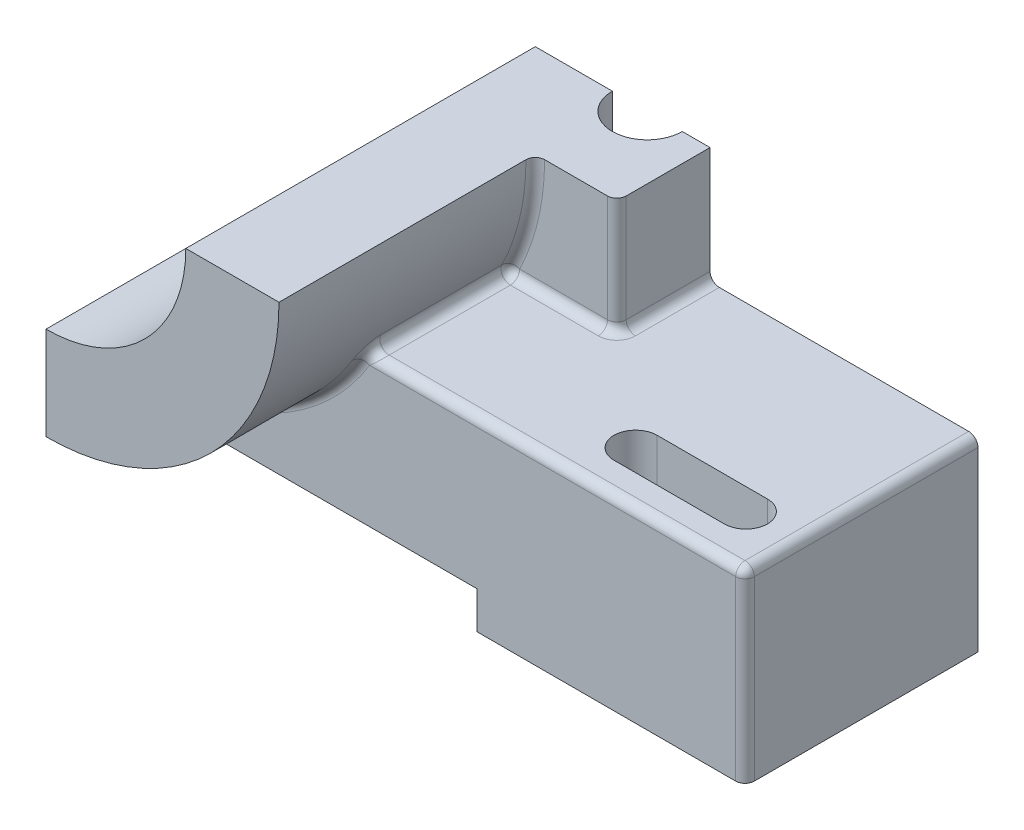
ISO-10303-21;
HEADER;
FILE_DESCRIPTION(('STEP AP214'),'2;1');
FILE_NAME('part.step','',(''),(''),'','','');
FILE_SCHEMA(('AUTOMOTIVE_DESIGN { 1 0 10303 214 1 1 1 1 }'));
ENDSEC;
DATA;
#1=APPLICATION_CONTEXT('core data for automotive mechanical design processes');
#2=APPLICATION_PROTOCOL_DEFINITION('international standard','automotive_design',2000,#1);
#3=PRODUCT_CONTEXT('',#1,'mechanical');
#4=PRODUCT('Part','Part','',(#3));
#5=PRODUCT_RELATED_PRODUCT_CATEGORY('part','',(#4));
#6=PRODUCT_DEFINITION_FORMATION('','',#4);
#7=PRODUCT_DEFINITION_CONTEXT('part definition',#1,'design');
#8=PRODUCT_DEFINITION('design','',#6,#7);
#9=PRODUCT_DEFINITION_SHAPE('','',#8);
#10=(LENGTH_UNIT() NAMED_UNIT(*) SI_UNIT(.MILLI.,.METRE.));
#11=(NAMED_UNIT(*) PLANE_ANGLE_UNIT() SI_UNIT($,.RADIAN.));
#12=(NAMED_UNIT(*) SI_UNIT($,.STERADIAN.) SOLID_ANGLE_UNIT());
#13=UNCERTAINTY_MEASURE_WITH_UNIT(LENGTH_MEASURE(1.E-05),#10,'distance_accuracy_value','');
#14=(GEOMETRIC_REPRESENTATION_CONTEXT(3) GLOBAL_UNCERTAINTY_ASSIGNED_CONTEXT((#13)) GLOBAL_UNIT_ASSIGNED_CONTEXT((#10,
#11,#12)) REPRESENTATION_CONTEXT('',''));
#15=CARTESIAN_POINT('',(0.,0.,0.));
#16=DIRECTION('',(0.,0.,1.));
#17=DIRECTION('',(1.,0.,0.));
#18=AXIS2_PLACEMENT_3D('',#15,#16,#17);
#19=CARTESIAN_POINT('',(0.,0.,75.));
#20=DIRECTION('',(0.,0.,-1.));
#21=DIRECTION('',(-1.,0.,0.));
#22=AXIS2_PLACEMENT_3D('',#19,#20,#21);
#23=CYLINDRICAL_SURFACE('',#22,50.);
#24=DIRECTION('',(0.,0.,-1.));
#25=VECTOR('',#24,1.);
#26=CARTESIAN_POINT('',(0.,-50.,75.));
#27=LINE('',#26,#25);
#28=CARTESIAN_POINT('',(0.,-50.,75.));
#29=VERTEX_POINT('',#28);
#30=CARTESIAN_POINT('',(0.,-50.,52.));
#31=VERTEX_POINT('',#30);
#32=EDGE_CURVE('E270',#29,#31,#27,.T.);
#33=ORIENTED_EDGE('',*,*,#32,.T.);
#34=CARTESIAN_POINT('',(0.,0.,52.));
#35=DIRECTION('',(0.,0.,1.));
#36=DIRECTION('',(1.,0.,0.));
#37=AXIS2_PLACEMENT_3D('',#34,#35,#36);
#38=CIRCLE('',#37,50.);
#39=CARTESIAN_POINT('',(42.7317039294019,-25.9615384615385,52.));
#40=VERTEX_POINT('',#39);
#41=EDGE_CURVE('E349',#31,#40,#38,.T.);
#42=ORIENTED_EDGE('',*,*,#41,.T.);
#43=CARTESIAN_POINT('',(41.6193649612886,-27.7097177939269,51.5629326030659));
#44=CARTESIAN_POINT('',(41.7673239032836,-27.487486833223,50.9343795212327));
#45=CARTESIAN_POINT('',(42.2320413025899,-27.5431307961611,50.4370879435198));
#46=CARTESIAN_POINT('',(42.6967587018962,-27.5987747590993,49.939796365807));
#47=CARTESIAN_POINT('',(43.2841395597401,-27.909053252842,49.7814663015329));
#48=CARTESIAN_POINT('',(41.6885360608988,-27.6058269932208,51.6180455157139));
#49=CARTESIAN_POINT('',(41.8288363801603,-27.3938964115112,50.9740695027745));
#50=CARTESIAN_POINT('',(42.2955432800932,-27.4637496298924,50.4676328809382));
#51=CARTESIAN_POINT('',(42.762431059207,-27.533377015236,49.9612844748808));
#52=CARTESIAN_POINT('',(43.3560775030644,-27.8550300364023,49.8090227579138));
#53=CARTESIAN_POINT('',(41.7584201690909,-27.5000154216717,51.6680242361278));
#54=CARTESIAN_POINT('',(41.8906623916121,-27.2991381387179,51.0089631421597));
#55=CARTESIAN_POINT('',(42.3594915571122,-27.3834538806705,50.4940658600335));
#56=CARTESIAN_POINT('',(42.8285081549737,-27.4675333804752,49.9792343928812));
#57=CARTESIAN_POINT('',(43.4287569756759,-27.8000080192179,49.8340121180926));
#58=CARTESIAN_POINT('',(41.8992133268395,-27.2850222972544,51.7576615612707));
#59=CARTESIAN_POINT('',(42.0146865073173,-27.1076310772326,51.069378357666));
#60=CARTESIAN_POINT('',(42.4878556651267,-27.2215818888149,50.5388060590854));
#61=CARTESIAN_POINT('',(42.9612126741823,-27.335295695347,50.0082987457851));
#62=CARTESIAN_POINT('',(43.575181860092,-27.6882115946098,49.8788307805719));
#63=CARTESIAN_POINT('',(41.970122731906,-27.175839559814,51.797316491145));
#64=CARTESIAN_POINT('',(42.0768917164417,-27.0108666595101,51.0948719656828));
#65=CARTESIAN_POINT('',(42.5522716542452,-27.1400052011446,50.5571103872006));
#66=CARTESIAN_POINT('',(43.0278482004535,-27.2688935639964,50.0193920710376));
#67=CARTESIAN_POINT('',(43.648927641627,-27.6314365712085,49.8986582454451));
#68=CARTESIAN_POINT('',(42.1824934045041,-26.8459486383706,51.9000749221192));
#69=CARTESIAN_POINT('',(42.2625789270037,-26.7198066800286,51.1570708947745));
#70=CARTESIAN_POINT('',(42.7444121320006,-26.8956654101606,50.5997051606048));
#71=CARTESIAN_POINT('',(43.2270106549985,-27.0705512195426,50.0425097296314));
#72=CARTESIAN_POINT('',(43.8697931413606,-27.4598932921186,49.9500374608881));
#73=CARTESIAN_POINT('',(42.3247962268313,-26.6211009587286,51.9479166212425));
#74=CARTESIAN_POINT('',(42.3856760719,-26.5239162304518,51.1798263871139));
#75=CARTESIAN_POINT('',(42.8721318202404,-26.7319134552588,50.6121961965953));
#76=CARTESIAN_POINT('',(43.3593737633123,-26.9388958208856,50.0445472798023));
#77=CARTESIAN_POINT('',(44.0177880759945,-27.3429724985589,49.9739583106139));
#78=CARTESIAN_POINT('',(42.5105633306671,-26.3222184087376,51.9830788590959));
#79=CARTESIAN_POINT('',(42.5442392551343,-26.2677931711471,51.1858878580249));
#80=CARTESIAN_POINT('',(43.0372599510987,-26.5187504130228,50.6084155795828));
#81=CARTESIAN_POINT('',(43.5303601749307,-26.769604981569,50.030941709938));
#82=CARTESIAN_POINT('',(44.2109858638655,-27.1875535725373,49.9915394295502));
#83=CARTESIAN_POINT('',(42.5549410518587,-26.2504118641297,51.9894068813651));
#84=CARTESIAN_POINT('',(42.5820636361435,-26.206402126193,51.1855302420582));
#85=CARTESIAN_POINT('',(43.0765856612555,-26.4678739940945,50.6059875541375));
#86=CARTESIAN_POINT('',(43.5711858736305,-26.7292445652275,50.0264371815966));
#87=CARTESIAN_POINT('',(44.2571386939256,-27.1502141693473,49.9947034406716));
#88=CARTESIAN_POINT('',(42.6435020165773,-26.1063002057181,51.9978715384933));
#89=CARTESIAN_POINT('',(42.6572691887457,-26.0837710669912,51.1812425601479));
#90=CARTESIAN_POINT('',(43.1548129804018,-26.3664732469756,50.5981350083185));
#91=CARTESIAN_POINT('',(43.6524355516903,-26.6490732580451,50.0150193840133));
#92=CARTESIAN_POINT('',(44.3492420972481,-27.0752761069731,49.9989357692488));
#93=CARTESIAN_POINT('',(42.6876848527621,-26.0339944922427,52.0000016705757));
#94=CARTESIAN_POINT('',(42.6946489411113,-26.0225313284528,51.177299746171));
#95=CARTESIAN_POINT('',(43.1937138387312,-26.3159495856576,50.5927058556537));
#96=CARTESIAN_POINT('',(43.6928582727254,-26.6092641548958,50.0080975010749));
#97=CARTESIAN_POINT('',(44.3951922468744,-27.0376771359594,50.0000008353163));
#98=CARTESIAN_POINT('',(42.902108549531,-25.6810500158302,51.9999935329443));
#99=CARTESIAN_POINT('',(42.8758600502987,-25.7242561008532,51.1492934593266));
#100=CARTESIAN_POINT('',(43.3818531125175,-26.0711605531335,50.5590003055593));
#101=CARTESIAN_POINT('',(43.8890180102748,-26.416541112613,49.9684980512));
#102=CARTESIAN_POINT('',(44.6181928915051,-26.8541460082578,49.999996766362));
#103=CARTESIAN_POINT('',(43.0700590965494,-25.3983089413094,51.9680402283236));
#104=CARTESIAN_POINT('',(43.0151205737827,-25.4906775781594,51.1000084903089));
#105=CARTESIAN_POINT('',(43.5272074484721,-25.8806836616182,50.5098813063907));
#106=CARTESIAN_POINT('',(44.0403809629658,-26.2692615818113,49.9191982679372));
#107=CARTESIAN_POINT('',(44.7928614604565,-26.7071206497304,49.9840201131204));
#108=CARTESIAN_POINT('',(43.3945636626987,-24.8398141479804,51.8376796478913));
#109=CARTESIAN_POINT('',(43.2794255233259,-25.0401811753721,50.950306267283));
#110=CARTESIAN_POINT('',(43.8036177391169,-25.5174626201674,50.3704497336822));
#111=CARTESIAN_POINT('',(44.3289139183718,-25.9932936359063,49.7900441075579));
#112=CARTESIAN_POINT('',(45.130346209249,-26.416703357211,49.9188398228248));
#113=CARTESIAN_POINT('',(43.551098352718,-24.5640727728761,51.7391624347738));
#114=CARTESIAN_POINT('',(43.4043028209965,-24.8234749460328,50.849411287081));
#115=CARTESIAN_POINT('',(43.9346496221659,-25.3447483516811,50.2800690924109));
#116=CARTESIAN_POINT('',(44.4659142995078,-25.8648159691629,49.7099087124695));
#117=CARTESIAN_POINT('',(45.293142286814,-26.2733178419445,49.8695812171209));
#118=CARTESIAN_POINT('',(43.8243258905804,-24.0727153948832,51.4941696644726));
#119=CARTESIAN_POINT('',(43.6178020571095,-24.448066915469,50.6196950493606));
#120=CARTESIAN_POINT('',(44.1592015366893,-25.0495203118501,50.0800167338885));
#121=CARTESIAN_POINT('',(44.7012777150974,-25.6500831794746,49.5397359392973));
#122=CARTESIAN_POINT('',(45.5772989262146,-26.0178120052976,49.747084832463));
#123=CARTESIAN_POINT('',(43.9434884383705,-23.8542345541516,51.3569278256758));
#124=CARTESIAN_POINT('',(43.7090114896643,-24.2855716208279,50.4969001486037));
#125=CARTESIAN_POINT('',(44.2554035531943,-24.9233597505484,49.9751666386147));
#126=CARTESIAN_POINT('',(44.8023180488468,-25.5604677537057,49.4527431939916));
#127=CARTESIAN_POINT('',(45.7012279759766,-25.9042019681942,49.6784639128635));
#128=CARTESIAN_POINT('',(44.1644184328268,-23.4426654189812,51.0346388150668));
#129=CARTESIAN_POINT('',(43.8750420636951,-23.9872309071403,50.2222764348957));
#130=CARTESIAN_POINT('',(44.4307814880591,-24.6948572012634,49.7449883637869));
#131=CARTESIAN_POINT('',(44.9870456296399,-25.4017992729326,49.2670158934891));
#132=CARTESIAN_POINT('',(45.9309951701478,-25.6901860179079,49.517319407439));
#133=CARTESIAN_POINT('',(44.2662149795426,-23.2495347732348,50.8496729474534));
#134=CARTESIAN_POINT('',(43.949733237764,-23.8516070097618,50.0704215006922));
#135=CARTESIAN_POINT('',(44.5099859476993,-24.5924752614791,49.6196951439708));
#136=CARTESIAN_POINT('',(45.0705920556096,-25.3328914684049,49.1682975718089));
#137=CARTESIAN_POINT('',(46.0368635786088,-25.5897580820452,49.424836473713));
#138=CARTESIAN_POINT('',(44.4359597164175,-22.9232369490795,50.4641927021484));
#139=CARTESIAN_POINT('',(44.072089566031,-23.6282075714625,49.7660205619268));
#140=CARTESIAN_POINT('',(44.6399220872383,-24.426179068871,49.3725046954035));
#141=CARTESIAN_POINT('',(45.208023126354,-25.2238066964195,48.9784770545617));
#142=CARTESIAN_POINT('',(46.2133981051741,-25.4200832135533,49.2320963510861));
#143=CARTESIAN_POINT('',(44.5066235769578,-22.7854928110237,50.2691626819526));
#144=CARTESIAN_POINT('',(44.121965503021,-23.5365787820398,49.616293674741));
#145=CARTESIAN_POINT('',(44.6930556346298,-24.3589352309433,49.2524391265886));
#146=CARTESIAN_POINT('',(45.2643059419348,-25.1810909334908,48.8881472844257));
#147=CARTESIAN_POINT('',(46.2868885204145,-25.3484562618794,49.1345813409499));
#148=CARTESIAN_POINT('',(44.62926349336,-22.5443388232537,49.851746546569));
#149=CARTESIAN_POINT('',(44.2074231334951,-23.3791578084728,49.3042644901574));
#150=CARTESIAN_POINT('',(44.784150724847,-24.2447517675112,49.0052628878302));
#151=CARTESIAN_POINT('',(45.3610402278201,-25.1101427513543,48.70582463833));
#152=CARTESIAN_POINT('',(46.4144340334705,-25.223056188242,48.9258732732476));
#153=CARTESIAN_POINT('',(44.6812610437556,-22.4408894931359,49.6293922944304));
#154=CARTESIAN_POINT('',(44.2429277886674,-23.3135063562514,49.1420890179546));
#155=CARTESIAN_POINT('',(44.8221297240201,-24.1977887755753,48.8781605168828));
#156=CARTESIAN_POINT('',(45.4014053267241,-25.0819805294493,48.6139194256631));
#157=CARTESIAN_POINT('',(46.4685114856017,-25.1692625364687,48.8146961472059));
#158=CARTESIAN_POINT('',(44.759328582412,-22.2847300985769,49.1937925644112));
#159=CARTESIAN_POINT('',(44.295784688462,-23.2156610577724,48.8303532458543));
#160=CARTESIAN_POINT('',(44.8786766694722,-24.1284088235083,48.6360986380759));
#161=CARTESIAN_POINT('',(45.4616252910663,-25.0410873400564,48.4415991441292));
#162=CARTESIAN_POINT('',(46.5497017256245,-25.0880596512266,48.5968962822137));
#163=CARTESIAN_POINT('',(44.7878112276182,-22.2273244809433,48.9828264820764));
#164=CARTESIAN_POINT('',(44.3147963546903,-23.180411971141,48.6818036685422));
#165=CARTESIAN_POINT('',(44.8990654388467,-24.1036730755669,48.5215835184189));
#166=CARTESIAN_POINT('',(45.4833512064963,-25.026913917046,48.3612263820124));
#167=CARTESIAN_POINT('',(46.5793236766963,-25.0582087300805,48.4914132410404));
#168=CARTESIAN_POINT('',(44.8278863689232,-22.1463923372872,48.5522782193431));
#169=CARTESIAN_POINT('',(44.3414735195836,-23.1309361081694,48.3813806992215));
#170=CARTESIAN_POINT('',(44.9276592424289,-24.0690981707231,48.291154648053));
#171=CARTESIAN_POINT('',(45.5138623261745,-25.0072393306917,48.2007912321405));
#172=CARTESIAN_POINT('',(46.6210018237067,-25.0161240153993,48.2761391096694));
#173=CARTESIAN_POINT('',(44.8394822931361,-22.1228589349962,48.3326977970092));
#174=CARTESIAN_POINT('',(44.3491144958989,-23.1167547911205,48.2296539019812));
#175=CARTESIAN_POINT('',(44.9358667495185,-24.0592559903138,48.1752411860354));
#176=CARTESIAN_POINT('',(45.5226195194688,-25.0017565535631,48.1208091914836));
#177=CARTESIAN_POINT('',(46.6330615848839,-25.0038866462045,48.1663488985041));
#178=CARTESIAN_POINT('',(44.8451443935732,-22.1113782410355,47.9080222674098));
#179=CARTESIAN_POINT('',(44.3528554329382,-23.1098125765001,47.9364752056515));
#180=CARTESIAN_POINT('',(44.9398802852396,-24.0544355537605,47.9515313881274));
#181=CARTESIAN_POINT('',(45.5269053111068,-24.9990583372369,47.9665690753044));
#182=CARTESIAN_POINT('',(46.6389501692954,-24.9979166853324,47.9540111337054));
#183=CARTESIAN_POINT('',(44.840408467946,-22.1209991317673,47.7030180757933));
#184=CARTESIAN_POINT('',(44.3497405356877,-23.1155944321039,47.7951959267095));
#185=CARTESIAN_POINT('',(44.9365337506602,-24.0584416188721,47.8437492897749));
#186=CARTESIAN_POINT('',(45.5233338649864,-25.0012805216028,47.8923798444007));
#187=CARTESIAN_POINT('',(46.6340248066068,-25.0029195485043,47.8515090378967));
#188=CARTESIAN_POINT('',(44.8222578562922,-22.1577377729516,47.3992271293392));
#189=CARTESIAN_POINT('',(44.3377061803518,-23.1379212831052,47.5845183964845));
#190=CARTESIAN_POINT('',(44.9236309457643,-24.0739844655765,47.6826794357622));
#191=CARTESIAN_POINT('',(45.5095569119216,-25.0100461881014,47.7808599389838));
#192=CARTESIAN_POINT('',(46.6151481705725,-25.0220236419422,47.6996135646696));
#193=CARTESIAN_POINT('',(44.8143523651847,-22.1737305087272,47.2984785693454));
#194=CARTESIAN_POINT('',(44.3324618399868,-23.1476501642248,47.514468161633));
#195=CARTESIAN_POINT('',(44.9180060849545,-24.0807665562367,47.6290338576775));
#196=CARTESIAN_POINT('',(45.5035545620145,-25.0138778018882,47.7436302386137));
#197=CARTESIAN_POINT('',(46.6069264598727,-25.0303398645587,47.6492392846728));
#198=CARTESIAN_POINT('',(44.7949153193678,-22.2129695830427,47.0989013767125));
#199=CARTESIAN_POINT('',(44.3195145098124,-23.1716604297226,47.3750761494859));
#200=CARTESIAN_POINT('',(44.9041297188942,-24.0975546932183,47.5220680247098));
#201=CARTESIAN_POINT('',(45.48874870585,-25.0234444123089,47.6690909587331));
#202=CARTESIAN_POINT('',(46.5867119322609,-25.0507441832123,47.5494506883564));
#203=CARTESIAN_POINT('',(44.783383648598,-22.2362161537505,47.0000728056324));
#204=CARTESIAN_POINT('',(44.3118142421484,-23.18593676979,47.3057488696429));
#205=CARTESIAN_POINT('',(44.8958781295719,-24.10756084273,47.4687477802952));
#206=CARTESIAN_POINT('',(45.4799483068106,-25.0291773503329,47.6317893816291));
#207=CARTESIAN_POINT('',(46.574718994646,-25.0628323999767,47.5000364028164));
#208=CARTESIAN_POINT('',(44.770072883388,-22.2629866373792,46.9025098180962));
#209=CARTESIAN_POINT('',(44.3028839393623,-23.2024869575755,47.2368564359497));
#210=CARTESIAN_POINT('',(44.8863179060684,-24.1191969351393,47.4156346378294));
#211=CARTESIAN_POINT('',(45.4697518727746,-25.0359069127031,47.5944128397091));
#212=CARTESIAN_POINT('',(46.5608757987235,-25.0767530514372,47.4512549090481));
#213=(BOUNDED_SURFACE() B_SPLINE_SURFACE(3,2,((#43,#44,#45,#46,#47),(#48,#49,#50,#51,#52),(#53,
#54,#55,#56,#57),(#58,#59,#60,#61,#62),(#63,#64,#65,#66,#67),(#68,#69,#70,#71,#72),(#73,#74,#75,
#76,#77),(#78,#79,#80,#81,#82),(#83,#84,#85,#86,#87),(#88,#89,#90,#91,#92),(#93,#94,#95,#96,
#97),(#98,#99,#100,#101,#102),(#103,#104,#105,#106,#107),(#108,#109,#110,#111,#112),(#113,#114,
#115,#116,#117),(#118,#119,#120,#121,#122),(#123,#124,#125,#126,#127),(#128,#129,#130,#131,
#132),(#133,#134,#135,#136,#137),(#138,#139,#140,#141,#142),(#143,#144,#145,#146,#147),(#148,
#149,#150,#151,#152),(#153,#154,#155,#156,#157),(#158,#159,#160,#161,#162),(#163,#164,#165,#166,
#167),(#168,#169,#170,#171,#172),(#173,#174,#175,#176,#177),(#178,#179,#180,#181,#182),(#183,
#184,#185,#186,#187),(#188,#189,#190,#191,#192),(#193,#194,#195,#196,#197),(#198,#199,#200,#201,
#202),(#203,#204,#205,#206,#207),(#208,#209,#210,#211,#212)),.UNSPECIFIED.,.F.,.F.,
.F.) B_SPLINE_SURFACE_WITH_KNOTS((4,2,2,2,2,2,2,2,2,2,2,2,2,2,2,2,4),(3,2,3),(0.,
0.422761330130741,0.84567294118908,1.68425720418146,1.94824623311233,2.21264387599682,
3.23616784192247,4.261386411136,5.1351657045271,6.00746611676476,6.76181554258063,
7.51529351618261,8.17550464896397,8.83558173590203,9.44830514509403,9.75531416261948,
10.062333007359),(0.,0.5,1.),
.UNSPECIFIED.) GEOMETRIC_REPRESENTATION_ITEM() RATIONAL_B_SPLINE_SURFACE(((1.,0.946353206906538,
1.,0.946353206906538,1.),(1.,0.945024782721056,1.,0.945024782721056,1.),(1.,0.943670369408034,
1.,0.943670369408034,1.),(1.,0.940915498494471,1.,0.940915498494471,1.),(1.,0.939515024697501,
1.,0.939515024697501,1.),(1.,0.935279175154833,1.,0.935279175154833,1.),(1.,0.932386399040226,
1.,0.932386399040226,1.),(1.,0.928534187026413,1.,0.928534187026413,1.),(1.,0.927608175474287,
1.,0.927608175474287,1.),(1.,0.925748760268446,1.,0.925748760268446,1.),(1.,0.924815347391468,
1.,0.924815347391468,1.),(1.,0.920256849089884,1.,0.920256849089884,1.),(1.,0.916598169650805,
1.,0.916598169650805,1.),(1.,0.909362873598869,1.,0.909362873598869,1.),(1.,0.905786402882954,
1.,0.905786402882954,1.),(1.,0.899412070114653,1.,0.899412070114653,1.),(1.,0.896577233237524,
1.,0.896577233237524,1.),(1.,0.891239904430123,1.,0.891239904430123,1.),(1.,0.888736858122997,
1.,0.888736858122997,1.),(1.,0.88451232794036,1.,0.88451232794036,1.),(1.,0.882730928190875,1.,
0.882730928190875,1.),(1.,0.87961536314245,1.,0.87961536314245,1.),(1.,0.878280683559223,1.,
0.878280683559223,1.),(1.,0.876267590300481,1.,0.876267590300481,1.),(1.,0.875528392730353,1.,
0.875528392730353,1.),(1.,0.874486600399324,1.,0.874486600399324,1.),(1.,0.874183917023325,1.,
0.874183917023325,1.),(1.,0.874036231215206,1.,0.874036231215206,1.),(1.,0.874159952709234,1.,
0.874159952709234,1.),(1.,0.874632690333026,1.,0.874632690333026,1.),(1.,0.874838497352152,1.,
0.874838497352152,1.),(1.,0.875343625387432,1.,0.875343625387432,1.),(1.,0.875642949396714,1.,
0.875642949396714,1.),(1.,0.87598777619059,1.,0.87598777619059,1.))) REPRESENTATION_ITEM('') SURFACE());
#214=CARTESIAN_POINT('',(44.770072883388,-22.2629866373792,46.9025098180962));
#215=CARTESIAN_POINT('',(44.783383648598,-22.2362161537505,47.0000728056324));
#216=CARTESIAN_POINT('',(44.7949153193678,-22.2129695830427,47.0989013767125));
#217=CARTESIAN_POINT('',(44.8143523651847,-22.1737305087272,47.2984785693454));
#218=CARTESIAN_POINT('',(44.8222578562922,-22.1577377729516,47.3992271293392));
#219=CARTESIAN_POINT('',(44.840408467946,-22.1209991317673,47.7030180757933));
#220=CARTESIAN_POINT('',(44.8451443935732,-22.1113782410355,47.9080222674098));
#221=CARTESIAN_POINT('',(44.8394822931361,-22.1228589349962,48.3326977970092));
#222=CARTESIAN_POINT('',(44.8278863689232,-22.1463923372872,48.5522782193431));
#223=CARTESIAN_POINT('',(44.7878112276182,-22.2273244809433,48.9828264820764));
#224=CARTESIAN_POINT('',(44.759328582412,-22.2847300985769,49.1937925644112));
#225=CARTESIAN_POINT('',(44.6812610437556,-22.4408894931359,49.6293922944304));
#226=CARTESIAN_POINT('',(44.62926349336,-22.5443388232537,49.851746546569));
#227=CARTESIAN_POINT('',(44.5066235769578,-22.7854928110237,50.2691626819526));
#228=CARTESIAN_POINT('',(44.4359597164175,-22.9232369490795,50.4641927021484));
#229=CARTESIAN_POINT('',(44.2662149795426,-23.2495347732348,50.8496729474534));
#230=CARTESIAN_POINT('',(44.1644184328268,-23.4426654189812,51.0346388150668));
#231=CARTESIAN_POINT('',(43.9434884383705,-23.8542345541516,51.3569278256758));
#232=CARTESIAN_POINT('',(43.8243258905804,-24.0727153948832,51.4941696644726));
#233=CARTESIAN_POINT('',(43.551098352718,-24.5640727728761,51.7391624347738));
#234=CARTESIAN_POINT('',(43.3945636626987,-24.8398141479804,51.8376796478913));
#235=CARTESIAN_POINT('',(43.0700590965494,-25.3983089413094,51.9680402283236));
#236=CARTESIAN_POINT('',(42.902108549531,-25.6810500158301,51.9999935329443));
#237=CARTESIAN_POINT('',(42.6876848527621,-26.0339944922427,52.0000016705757));
#238=CARTESIAN_POINT('',(42.6435020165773,-26.1063002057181,51.9978715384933));
#239=CARTESIAN_POINT('',(42.5549410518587,-26.2504118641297,51.9894068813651));
#240=CARTESIAN_POINT('',(42.5105633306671,-26.3222184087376,51.9830788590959));
#241=CARTESIAN_POINT('',(42.3247962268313,-26.6211009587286,51.9479166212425));
#242=CARTESIAN_POINT('',(42.1824934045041,-26.8459486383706,51.9000749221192));
#243=CARTESIAN_POINT('',(41.970122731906,-27.175839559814,51.797316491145));
#244=CARTESIAN_POINT('',(41.8992133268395,-27.2850222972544,51.7576615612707));
#245=CARTESIAN_POINT('',(41.7584201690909,-27.5000154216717,51.6680242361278));
#246=CARTESIAN_POINT('',(41.6885360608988,-27.6058269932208,51.6180455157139));
#247=CARTESIAN_POINT('',(41.6193649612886,-27.7097177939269,51.5629326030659));
#248=B_SPLINE_CURVE_WITH_KNOTS('',3,(#214,#215,#216,#217,#218,#219,#220,#221,#222,#223,#224,
#225,#226,#227,#228,#229,#230,#231,#232,#233,#234,#235,#236,#237,#238,#239,#240,#241,#242,#243,
#244,#245,#246,#247),.UNSPECIFIED.,.F.,.F.,(4,2,2,2,2,2,2,2,2,2,2,2,2,2,2,2,4),(0.,
0.307018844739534,0.614027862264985,1.22675127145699,1.88682835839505,2.54703949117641,
3.30051746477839,4.05486689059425,4.92716730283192,5.80094659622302,6.82616516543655,
7.8496891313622,8.11408677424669,8.37807580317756,9.21666006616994,9.63957167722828,
10.062333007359),.UNSPECIFIED.);
#249=CARTESIAN_POINT('',(44.8431685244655,-22.1153846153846,48.));
#250=VERTEX_POINT('',#249);
#251=EDGE_CURVE('E342',#250,#40,#248,.T.);
#252=ORIENTED_EDGE('',*,*,#251,.F.);
#253=DIRECTION('',(0.,0.,-1.));
#254=VECTOR('',#253,1.);
#255=CARTESIAN_POINT('',(44.8431685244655,-22.1153846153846,75.));
#256=LINE('',#255,#254);
#257=CARTESIAN_POINT('',(44.8431685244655,-22.1153846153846,22.));
#258=VERTEX_POINT('',#257);
#259=EDGE_CURVE('E337',#250,#258,#256,.T.);
#260=ORIENTED_EDGE('',*,*,#259,.T.);
#261=CARTESIAN_POINT('',(0.,0.,22.));
#262=DIRECTION('',(0.,0.,-1.));
#263=DIRECTION('',(-1.,0.,0.));
#264=AXIS2_PLACEMENT_3D('',#261,#262,#263);
#265=CIRCLE('',#264,50.);
#266=CARTESIAN_POINT('',(50.,0.,22.));
#267=VERTEX_POINT('',#266);
#268=EDGE_CURVE('E338',#258,#267,#265,.F.);
#269=ORIENTED_EDGE('',*,*,#268,.T.);
#270=DIRECTION('',(0.,0.,-1.));
#271=VECTOR('',#270,1.);
#272=CARTESIAN_POINT('',(50.,0.,75.));
#273=LINE('',#272,#271);
#274=CARTESIAN_POINT('',(50.,0.,75.));
#275=VERTEX_POINT('',#274);
#276=EDGE_CURVE('E277',#275,#267,#273,.T.);
#277=ORIENTED_EDGE('',*,*,#276,.F.);
#278=CARTESIAN_POINT('',(0.,0.,75.));
#279=DIRECTION('',(0.,0.,1.));
#280=DIRECTION('',(1.,0.,0.));
#281=AXIS2_PLACEMENT_3D('',#278,#279,#280);
#282=CIRCLE('',#281,50.);
#283=EDGE_CURVE('E307',#29,#275,#282,.T.);
#284=ORIENTED_EDGE('',*,*,#283,.F.);
#285=EDGE_LOOP('',(#33,#42,#252,#260,#269,#277,#284));
#286=FACE_BOUND('',#285,.T.);
#287=ADVANCED_FACE('F14',(#286),#23,.T.);
#288=CARTESIAN_POINT('',(0.,0.,75.));
#289=DIRECTION('',(0.,0.,1.));
#290=DIRECTION('',(1.,0.,0.));
#291=AXIS2_PLACEMENT_3D('',#288,#289,#290);
#292=PLANE('',#291);
#293=DIRECTION('',(0.,1.,0.));
#294=VECTOR('',#293,1.);
#295=CARTESIAN_POINT('',(0.,-64.9999999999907,75.));
#296=LINE('',#295,#294);
#297=CARTESIAN_POINT('',(0.,-30.,75.));
#298=VERTEX_POINT('',#297);
#299=EDGE_CURVE('E231',#29,#298,#296,.T.);
#300=ORIENTED_EDGE('',*,*,#299,.F.);
#301=ORIENTED_EDGE('',*,*,#283,.T.);
#302=DIRECTION('',(-1.,0.,0.));
#303=VECTOR('',#302,1.);
#304=CARTESIAN_POINT('',(0.,0.,75.));
#305=LINE('',#304,#303);
#306=CARTESIAN_POINT('',(30.,0.,75.));
#307=VERTEX_POINT('',#306);
#308=EDGE_CURVE('E272',#275,#307,#305,.T.);
#309=ORIENTED_EDGE('',*,*,#308,.T.);
#310=CARTESIAN_POINT('',(0.,0.,75.));
#311=DIRECTION('',(0.,0.,1.));
#312=DIRECTION('',(1.,0.,0.));
#313=AXIS2_PLACEMENT_3D('',#310,#311,#312);
#314=CIRCLE('',#313,30.);
#315=EDGE_CURVE('E283',#298,#307,#314,.T.);
#316=ORIENTED_EDGE('',*,*,#315,.F.);
#317=EDGE_LOOP('',(#300,#301,#309,#316));
#318=FACE_BOUND('',#317,.T.);
#319=ADVANCED_FACE('F359',(#318),#292,.T.);
#320=CARTESIAN_POINT('',(0.,0.,20.));
#321=DIRECTION('',(0.,0.,-1.));
#322=DIRECTION('',(-1.,0.,0.));
#323=AXIS2_PLACEMENT_3D('',#320,#321,#322);
#324=PLANE('',#323);
#325=DIRECTION('',(1.,0.,0.));
#326=VECTOR('',#325,1.);
#327=CARTESIAN_POINT('',(67.4999999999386,-23.,20.));
#328=LINE('',#327,#326);
#329=CARTESIAN_POINT('',(46.6368952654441,-23.,20.));
#330=VERTEX_POINT('',#329);
#331=CARTESIAN_POINT('',(65.4999999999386,-23.,20.));
#332=VERTEX_POINT('',#331);
#333=EDGE_CURVE('E33',#330,#332,#328,.T.);
#334=ORIENTED_EDGE('',*,*,#333,.T.);
#335=DIRECTION('',(0.,1.,0.));
#336=VECTOR('',#335,1.);
#337=CARTESIAN_POINT('',(65.4999999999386,0.,20.));
#338=LINE('',#337,#336);
#339=CARTESIAN_POINT('',(65.4999999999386,0.,20.));
#340=VERTEX_POINT('',#339);
#341=EDGE_CURVE('E427',#332,#340,#338,.T.);
#342=ORIENTED_EDGE('',*,*,#341,.T.);
#343=DIRECTION('',(1.,0.,0.));
#344=VECTOR('',#343,1.);
#345=CARTESIAN_POINT('',(0.,0.,20.));
#346=LINE('',#345,#344);
#347=CARTESIAN_POINT('',(52.,0.,20.));
#348=VERTEX_POINT('',#347);
#349=EDGE_CURVE('E276',#348,#340,#346,.T.);
#350=ORIENTED_EDGE('',*,*,#349,.F.);
#351=CARTESIAN_POINT('',(0.,0.,20.));
#352=DIRECTION('',(0.,0.,-1.));
#353=DIRECTION('',(-1.,0.,0.));
#354=AXIS2_PLACEMENT_3D('',#351,#352,#353);
#355=CIRCLE('',#354,52.);
#356=EDGE_CURVE('E38',#348,#330,#355,.T.);
#357=ORIENTED_EDGE('',*,*,#356,.T.);
#358=EDGE_LOOP('',(#334,#342,#350,#357));
#359=FACE_BOUND('',#358,.T.);
#360=ADVANCED_FACE('F536',(#359),#324,.F.);
#361=CARTESIAN_POINT('',(67.4999999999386,-25.,20.));
#362=DIRECTION('',(-1.,0.,0.));
#363=DIRECTION('',(0.,0.,1.));
#364=AXIS2_PLACEMENT_3D('',#361,#362,#363);
#365=PLANE('',#364);
#366=DIRECTION('',(0.,1.,0.));
#367=VECTOR('',#366,1.);
#368=CARTESIAN_POINT('',(67.4999999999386,-25.,18.));
#369=LINE('',#368,#367);
#370=CARTESIAN_POINT('',(67.4999999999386,0.,18.));
#371=VERTEX_POINT('',#370);
#372=CARTESIAN_POINT('',(67.4999999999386,-23.,18.));
#373=VERTEX_POINT('',#372);
#374=EDGE_CURVE('E317',#371,#373,#369,.F.);
#375=ORIENTED_EDGE('',*,*,#374,.T.);
#376=DIRECTION('',(0.,0.,-1.));
#377=VECTOR('',#376,1.);
#378=CARTESIAN_POINT('',(67.4999999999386,-23.,0.));
#379=LINE('',#378,#377);
#380=CARTESIAN_POINT('',(67.4999999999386,-23.,0.));
#381=VERTEX_POINT('',#380);
#382=EDGE_CURVE('E321',#373,#381,#379,.T.);
#383=ORIENTED_EDGE('',*,*,#382,.T.);
#384=DIRECTION('',(0.,1.,0.));
#385=VECTOR('',#384,1.);
#386=CARTESIAN_POINT('',(67.4999999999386,-25.,0.));
#387=LINE('',#386,#385);
#388=CARTESIAN_POINT('',(67.4999999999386,0.,0.));
#389=VERTEX_POINT('',#388);
#390=EDGE_CURVE('E244',#381,#389,#387,.T.);
#391=ORIENTED_EDGE('',*,*,#390,.T.);
#392=DIRECTION('',(0.,0.,-1.));
#393=VECTOR('',#392,1.);
#394=CARTESIAN_POINT('',(67.4999999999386,0.,20.));
#395=LINE('',#394,#393);
#396=EDGE_CURVE('E282',#371,#389,#395,.T.);
#397=ORIENTED_EDGE('',*,*,#396,.F.);
#398=EDGE_LOOP('',(#375,#383,#391,#397));
#399=FACE_BOUND('',#398,.T.);
#400=ADVANCED_FACE('F486',(#399),#365,.F.);
#401=CARTESIAN_POINT('',(54.0352622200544,55.,0.));
#402=DIRECTION('',(0.,1.,0.));
#403=DIRECTION('',(0.,0.,1.));
#404=AXIS2_PLACEMENT_3D('',#401,#402,#403);
#405=CYLINDRICAL_SURFACE('',#404,7.5);
#406=CARTESIAN_POINT('',(54.0352622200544,0.,0.));
#407=DIRECTION('',(0.,1.,0.));
#408=DIRECTION('',(0.,0.,1.));
#409=AXIS2_PLACEMENT_3D('',#406,#407,#408);
#410=CIRCLE('',#409,7.5);
#411=CARTESIAN_POINT('',(61.5352622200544,0.,0.));
#412=VERTEX_POINT('',#411);
#413=CARTESIAN_POINT('',(46.5352622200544,0.,0.));
#414=VERTEX_POINT('',#413);
#415=EDGE_CURVE('E285',#412,#414,#410,.F.);
#416=ORIENTED_EDGE('',*,*,#415,.F.);
#417=DIRECTION('',(0.,1.,0.));
#418=VECTOR('',#417,1.);
#419=CARTESIAN_POINT('',(61.5352622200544,55.,0.));
#420=LINE('',#419,#418);
#421=CARTESIAN_POINT('',(61.5352622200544,-56.9999999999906,0.));
#422=VERTEX_POINT('',#421);
#423=EDGE_CURVE('E238',#412,#422,#420,.F.);
#424=ORIENTED_EDGE('',*,*,#423,.T.);
#425=CARTESIAN_POINT('',(54.0352622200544,-56.9999999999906,0.));
#426=DIRECTION('',(0.,1.,0.));
#427=DIRECTION('',(0.,0.,1.));
#428=AXIS2_PLACEMENT_3D('',#425,#426,#427);
#429=CIRCLE('',#428,7.5);
#430=CARTESIAN_POINT('',(46.5352622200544,-56.9999999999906,0.));
#431=VERTEX_POINT('',#430);
#432=EDGE_CURVE('E295',#431,#422,#429,.T.);
#433=ORIENTED_EDGE('',*,*,#432,.F.);
#434=DIRECTION('',(0.,1.,0.));
#435=VECTOR('',#434,1.);
#436=CARTESIAN_POINT('',(46.5352622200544,55.,0.));
#437=LINE('',#436,#435);
#438=EDGE_CURVE('E261',#431,#414,#437,.T.);
#439=ORIENTED_EDGE('',*,*,#438,.T.);
#440=EDGE_LOOP('',(#416,#424,#433,#439));
#441=FACE_BOUND('',#440,.T.);
#442=ADVANCED_FACE('F529',(#441),#405,.F.);
#443=CARTESIAN_POINT('',(0.,0.,75.));
#444=DIRECTION('',(0.,0.,1.));
#445=DIRECTION('',(1.,0.,0.));
#446=AXIS2_PLACEMENT_3D('',#443,#444,#445);
#447=CYLINDRICAL_SURFACE('',#446,30.);
#448=DIRECTION('',(0.,0.,1.));
#449=VECTOR('',#448,1.);
#450=CARTESIAN_POINT('',(30.,0.,75.));
#451=LINE('',#450,#449);
#452=CARTESIAN_POINT('',(30.,0.,0.));
#453=VERTEX_POINT('',#452);
#454=EDGE_CURVE('E286',#453,#307,#451,.T.);
#455=ORIENTED_EDGE('',*,*,#454,.F.);
#456=CARTESIAN_POINT('',(0.,0.,0.));
#457=DIRECTION('',(0.,0.,1.));
#458=DIRECTION('',(1.,0.,0.));
#459=AXIS2_PLACEMENT_3D('',#456,#457,#458);
#460=CIRCLE('',#459,30.);
#461=CARTESIAN_POINT('',(0.,-30.,0.));
#462=VERTEX_POINT('',#461);
#463=EDGE_CURVE('E256',#453,#462,#460,.F.);
#464=ORIENTED_EDGE('',*,*,#463,.T.);
#465=DIRECTION('',(0.,0.,1.));
#466=VECTOR('',#465,1.);
#467=CARTESIAN_POINT('',(0.,-30.,75.));
#468=LINE('',#467,#466);
#469=EDGE_CURVE('E269',#462,#298,#468,.T.);
#470=ORIENTED_EDGE('',*,*,#469,.T.);
#471=ORIENTED_EDGE('',*,*,#315,.T.);
#472=EDGE_LOOP('',(#455,#464,#470,#471));
#473=FACE_BOUND('',#472,.T.);
#474=ADVANCED_FACE('F551',(#473),#447,.F.);
#475=CARTESIAN_POINT('',(-125.000000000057,-25.,50.));
#476=DIRECTION('',(0.,-1.,0.));
#477=DIRECTION('',(1.,0.,0.));
#478=AXIS2_PLACEMENT_3D('',#475,#476,#477);
#479=PLANE('',#478);
#480=DIRECTION('',(-1.,0.,0.));
#481=VECTOR('',#480,1.);
#482=CARTESIAN_POINT('',(-125.000000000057,-25.,0.));
#483=LINE('',#482,#481);
#484=CARTESIAN_POINT('',(123.000000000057,-25.,0.));
#485=VERTEX_POINT('',#484);
#486=CARTESIAN_POINT('',(69.4999999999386,-25.,0.));
#487=VERTEX_POINT('',#486);
#488=EDGE_CURVE('E253',#485,#487,#483,.T.);
#489=ORIENTED_EDGE('',*,*,#488,.T.);
#490=DIRECTION('',(0.,0.,-1.));
#491=VECTOR('',#490,1.);
#492=CARTESIAN_POINT('',(69.4999999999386,-25.,20.));
#493=LINE('',#492,#491);
#494=CARTESIAN_POINT('',(69.4999999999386,-25.,18.));
#495=VERTEX_POINT('',#494);
#496=EDGE_CURVE('E333',#487,#495,#493,.F.);
#497=ORIENTED_EDGE('',*,*,#496,.T.);
#498=CARTESIAN_POINT('',(65.4999999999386,-25.,18.));
#499=DIRECTION('',(0.,-1.,0.));
#500=DIRECTION('',(1.,0.,0.));
#501=AXIS2_PLACEMENT_3D('',#498,#499,#500);
#502=CIRCLE('',#501,4.);
#503=CARTESIAN_POINT('',(65.4999999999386,-25.,22.));
#504=VERTEX_POINT('',#503);
#505=EDGE_CURVE('E335',#504,#495,#502,.F.);
#506=ORIENTED_EDGE('',*,*,#505,.F.);
#507=DIRECTION('',(1.,0.,0.));
#508=VECTOR('',#507,1.);
#509=CARTESIAN_POINT('',(43.3012701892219,-25.,22.));
#510=LINE('',#509,#508);
#511=CARTESIAN_POINT('',(46.6368952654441,-25.,22.));
#512=VERTEX_POINT('',#511);
#513=EDGE_CURVE('E327',#504,#512,#510,.F.);
#514=ORIENTED_EDGE('',*,*,#513,.T.);
#515=DIRECTION('',(0.,0.,1.));
#516=VECTOR('',#515,1.);
#517=CARTESIAN_POINT('',(46.6368952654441,-25.,50.));
#518=LINE('',#517,#516);
#519=CARTESIAN_POINT('',(46.6368952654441,-25.,48.));
#520=VERTEX_POINT('',#519);
#521=EDGE_CURVE('E326',#512,#520,#518,.T.);
#522=ORIENTED_EDGE('',*,*,#521,.T.);
#523=DIRECTION('',(-1.,0.,0.));
#524=VECTOR('',#523,1.);
#525=CARTESIAN_POINT('',(125.000000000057,-25.,48.));
#526=LINE('',#525,#524);
#527=CARTESIAN_POINT('',(123.000000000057,-25.,48.));
#528=VERTEX_POINT('',#527);
#529=EDGE_CURVE('E322',#520,#528,#526,.F.);
#530=ORIENTED_EDGE('',*,*,#529,.T.);
#531=DIRECTION('',(0.,0.,-1.));
#532=VECTOR('',#531,1.);
#533=CARTESIAN_POINT('',(123.000000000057,-25.,50.));
#534=LINE('',#533,#532);
#535=EDGE_CURVE('E329',#528,#485,#534,.T.);
#536=ORIENTED_EDGE('',*,*,#535,.T.);
#537=EDGE_LOOP('',(#489,#497,#506,#514,#522,#530,#536));
#538=FACE_BOUND('',#537,.T.);
#539=DIRECTION('',(1.,0.,0.));
#540=VECTOR('',#539,1.);
#541=CARTESIAN_POINT('',(90.2988963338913,-25.,43.4201353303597));
#542=LINE('',#541,#540);
#543=CARTESIAN_POINT('',(90.2988963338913,-25.,43.4201353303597));
#544=VERTEX_POINT('',#543);
#545=CARTESIAN_POINT('',(113.97943765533,-25.,43.4201353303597));
#546=VERTEX_POINT('',#545);
#547=EDGE_CURVE('E225',#544,#546,#542,.T.);
#548=ORIENTED_EDGE('',*,*,#547,.F.);
#549=CARTESIAN_POINT('',(90.2988963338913,-25.,38.7869859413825));
#550=DIRECTION('',(0.,1.,0.));
#551=DIRECTION('',(-1.,0.,0.));
#552=AXIS2_PLACEMENT_3D('',#549,#550,#551);
#553=CIRCLE('',#552,4.63314938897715);
#554=CARTESIAN_POINT('',(90.2988963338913,-25.,34.1538365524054));
#555=VERTEX_POINT('',#554);
#556=EDGE_CURVE('E193',#555,#544,#553,.T.);
#557=ORIENTED_EDGE('',*,*,#556,.F.);
#558=DIRECTION('',(-1.,0.,0.));
#559=VECTOR('',#558,1.);
#560=CARTESIAN_POINT('',(90.2988963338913,-25.,34.1538365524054));
#561=LINE('',#560,#559);
#562=CARTESIAN_POINT('',(113.97943765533,-25.,34.1538365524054));
#563=VERTEX_POINT('',#562);
#564=EDGE_CURVE('E213',#563,#555,#561,.T.);
#565=ORIENTED_EDGE('',*,*,#564,.F.);
#566=CARTESIAN_POINT('',(113.97943765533,-25.,38.7869859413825));
#567=DIRECTION('',(0.,1.,0.));
#568=DIRECTION('',(-1.,0.,0.));
#569=AXIS2_PLACEMENT_3D('',#566,#567,#568);
#570=CIRCLE('',#569,4.63314938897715);
#571=EDGE_CURVE('E216',#546,#563,#570,.T.);
#572=ORIENTED_EDGE('',*,*,#571,.F.);
#573=EDGE_LOOP('',(#548,#557,#565,#572));
#574=FACE_BOUND('',#573,.T.);
#575=ADVANCED_FACE('F474',(#538,#574),#479,.F.);
#576=CARTESIAN_POINT('',(-125.000000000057,-64.9999999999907,50.));
#577=DIRECTION('',(0.,1.,0.));
#578=DIRECTION('',(0.,0.,1.));
#579=AXIS2_PLACEMENT_3D('',#576,#577,#578);
#580=PLANE('',#579);
#581=DIRECTION('',(-1.,0.,0.));
#582=VECTOR('',#581,1.);
#583=CARTESIAN_POINT('',(90.2988963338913,-64.9999999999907,34.1538365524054));
#584=LINE('',#583,#582);
#585=CARTESIAN_POINT('',(113.97943765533,-64.9999999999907,34.1538365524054));
#586=VERTEX_POINT('',#585);
#587=CARTESIAN_POINT('',(90.2988963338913,-64.9999999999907,34.1538365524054));
#588=VERTEX_POINT('',#587);
#589=EDGE_CURVE('E199',#586,#588,#584,.T.);
#590=ORIENTED_EDGE('',*,*,#589,.T.);
#591=CARTESIAN_POINT('',(90.2988963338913,-64.9999999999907,38.7869859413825));
#592=DIRECTION('',(0.,1.,0.));
#593=DIRECTION('',(-1.,0.,0.));
#594=AXIS2_PLACEMENT_3D('',#591,#592,#593);
#595=CIRCLE('',#594,4.63314938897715);
#596=CARTESIAN_POINT('',(90.2988963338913,-64.9999999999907,43.4201353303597));
#597=VERTEX_POINT('',#596);
#598=EDGE_CURVE('E195',#588,#597,#595,.T.);
#599=ORIENTED_EDGE('',*,*,#598,.T.);
#600=DIRECTION('',(1.,0.,0.));
#601=VECTOR('',#600,1.);
#602=CARTESIAN_POINT('',(90.2988963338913,-64.9999999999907,43.4201353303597));
#603=LINE('',#602,#601);
#604=CARTESIAN_POINT('',(113.97943765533,-64.9999999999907,43.4201353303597));
#605=VERTEX_POINT('',#604);
#606=EDGE_CURVE('E204',#597,#605,#603,.T.);
#607=ORIENTED_EDGE('',*,*,#606,.T.);
#608=CARTESIAN_POINT('',(113.97943765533,-64.9999999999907,38.7869859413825));
#609=DIRECTION('',(0.,1.,0.));
#610=DIRECTION('',(-1.,0.,0.));
#611=AXIS2_PLACEMENT_3D('',#608,#609,#610);
#612=CIRCLE('',#611,4.63314938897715);
#613=EDGE_CURVE('E208',#605,#586,#612,.T.);
#614=ORIENTED_EDGE('',*,*,#613,.T.);
#615=EDGE_LOOP('',(#590,#599,#607,#614));
#616=FACE_BOUND('',#615,.T.);
#617=DIRECTION('',(0.,0.,-1.));
#618=VECTOR('',#617,1.);
#619=CARTESIAN_POINT('',(125.000000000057,-64.9999999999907,50.));
#620=LINE('',#619,#618);
#621=CARTESIAN_POINT('',(125.000000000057,-64.9999999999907,48.));
#622=VERTEX_POINT('',#621);
#623=CARTESIAN_POINT('',(125.000000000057,-64.9999999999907,0.));
#624=VERTEX_POINT('',#623);
#625=EDGE_CURVE('E303',#622,#624,#620,.T.);
#626=ORIENTED_EDGE('',*,*,#625,.F.);
#627=CARTESIAN_POINT('',(123.000000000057,-64.9999999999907,48.));
#628=DIRECTION('',(0.,1.,0.));
#629=DIRECTION('',(0.,0.,1.));
#630=AXIS2_PLACEMENT_3D('',#627,#628,#629);
#631=CIRCLE('',#630,2.);
#632=CARTESIAN_POINT('',(123.000000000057,-64.9999999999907,50.));
#633=VERTEX_POINT('',#632);
#634=EDGE_CURVE('E414',#622,#633,#631,.F.);
#635=ORIENTED_EDGE('',*,*,#634,.T.);
#636=DIRECTION('',(1.,0.,0.));
#637=VECTOR('',#636,1.);
#638=CARTESIAN_POINT('',(-125.000000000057,-64.9999999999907,50.));
#639=LINE('',#638,#637);
#640=CARTESIAN_POINT('',(67.4999999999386,-64.9999999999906,50.));
#641=VERTEX_POINT('',#640);
#642=EDGE_CURVE('E305',#641,#633,#639,.T.);
#643=ORIENTED_EDGE('',*,*,#642,.F.);
#644=DIRECTION('',(0.,0.,1.));
#645=VECTOR('',#644,1.);
#646=CARTESIAN_POINT('',(67.4999999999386,-64.9999999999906,-75.));
#647=LINE('',#646,#645);
#648=CARTESIAN_POINT('',(67.4999999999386,-64.9999999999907,0.));
#649=VERTEX_POINT('',#648);
#650=EDGE_CURVE('E294',#649,#641,#647,.T.);
#651=ORIENTED_EDGE('',*,*,#650,.F.);
#652=DIRECTION('',(1.,0.,0.));
#653=VECTOR('',#652,1.);
#654=CARTESIAN_POINT('',(0.,-64.9999999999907,0.));
#655=LINE('',#654,#653);
#656=EDGE_CURVE('E229',#649,#624,#655,.T.);
#657=ORIENTED_EDGE('',*,*,#656,.T.);
#658=EDGE_LOOP('',(#626,#635,#643,#651,#657));
#659=FACE_BOUND('',#658,.T.);
#660=ADVANCED_FACE('F209',(#616,#659),#580,.F.);
#661=CARTESIAN_POINT('',(125.000000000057,-25.,50.));
#662=DIRECTION('',(-1.,0.,0.));
#663=DIRECTION('',(0.,0.,1.));
#664=AXIS2_PLACEMENT_3D('',#661,#662,#663);
#665=PLANE('',#664);
#666=DIRECTION('',(0.,0.,-1.));
#667=VECTOR('',#666,1.);
#668=CARTESIAN_POINT('',(125.000000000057,-27.,50.));
#669=LINE('',#668,#667);
#670=CARTESIAN_POINT('',(125.000000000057,-27.,0.));
#671=VERTEX_POINT('',#670);
#672=CARTESIAN_POINT('',(125.000000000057,-27.,48.));
#673=VERTEX_POINT('',#672);
#674=EDGE_CURVE('E421',#671,#673,#669,.F.);
#675=ORIENTED_EDGE('',*,*,#674,.T.);
#676=DIRECTION('',(0.,1.,0.));
#677=VECTOR('',#676,1.);
#678=CARTESIAN_POINT('',(125.000000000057,-64.9999999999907,48.));
#679=LINE('',#678,#677);
#680=EDGE_CURVE('E413',#673,#622,#679,.F.);
#681=ORIENTED_EDGE('',*,*,#680,.T.);
#682=ORIENTED_EDGE('',*,*,#625,.T.);
#683=DIRECTION('',(0.,1.,0.));
#684=VECTOR('',#683,1.);
#685=CARTESIAN_POINT('',(125.000000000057,-64.9999999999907,0.));
#686=LINE('',#685,#684);
#687=EDGE_CURVE('E233',#624,#671,#686,.T.);
#688=ORIENTED_EDGE('',*,*,#687,.T.);
#689=EDGE_LOOP('',(#675,#681,#682,#688));
#690=FACE_BOUND('',#689,.T.);
#691=ADVANCED_FACE('F512',(#690),#665,.F.);
#692=CARTESIAN_POINT('',(0.,0.,50.));
#693=DIRECTION('',(0.,0.,1.));
#694=DIRECTION('',(1.,0.,0.));
#695=AXIS2_PLACEMENT_3D('',#692,#693,#694);
#696=PLANE('',#695);
#697=DIRECTION('',(-1.,0.,0.));
#698=VECTOR('',#697,1.);
#699=CARTESIAN_POINT('',(43.3012701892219,-27.,50.));
#700=LINE('',#699,#698);
#701=CARTESIAN_POINT('',(123.000000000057,-27.,50.));
#702=VERTEX_POINT('',#701);
#703=CARTESIAN_POINT('',(44.440972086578,-27.,50.));
#704=VERTEX_POINT('',#703);
#705=EDGE_CURVE('E510',#702,#704,#700,.T.);
#706=ORIENTED_EDGE('',*,*,#705,.T.);
#707=CARTESIAN_POINT('',(0.,0.,50.));
#708=DIRECTION('',(0.,0.,1.));
#709=DIRECTION('',(1.,0.,0.));
#710=AXIS2_PLACEMENT_3D('',#707,#708,#709);
#711=CIRCLE('',#710,52.);
#712=CARTESIAN_POINT('',(0.,-52.,50.));
#713=VERTEX_POINT('',#712);
#714=EDGE_CURVE('E508',#704,#713,#711,.F.);
#715=ORIENTED_EDGE('',*,*,#714,.T.);
#716=DIRECTION('',(0.,1.,0.));
#717=VECTOR('',#716,1.);
#718=CARTESIAN_POINT('',(0.,0.,50.));
#719=LINE('',#718,#717);
#720=CARTESIAN_POINT('',(0.,-56.9999999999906,50.));
#721=VERTEX_POINT('',#720);
#722=EDGE_CURVE('E262',#721,#713,#719,.T.);
#723=ORIENTED_EDGE('',*,*,#722,.F.);
#724=DIRECTION('',(-1.,0.,0.));
#725=VECTOR('',#724,1.);
#726=CARTESIAN_POINT('',(0.,-56.9999999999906,50.));
#727=LINE('',#726,#725);
#728=CARTESIAN_POINT('',(67.4999999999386,-56.9999999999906,50.));
#729=VERTEX_POINT('',#728);
#730=EDGE_CURVE('E298',#729,#721,#727,.T.);
#731=ORIENTED_EDGE('',*,*,#730,.F.);
#732=DIRECTION('',(0.,1.,0.));
#733=VECTOR('',#732,1.);
#734=CARTESIAN_POINT('',(67.4999999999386,0.,50.));
#735=LINE('',#734,#733);
#736=EDGE_CURVE('E292',#641,#729,#735,.T.);
#737=ORIENTED_EDGE('',*,*,#736,.F.);
#738=ORIENTED_EDGE('',*,*,#642,.T.);
#739=DIRECTION('',(0.,1.,0.));
#740=VECTOR('',#739,1.);
#741=CARTESIAN_POINT('',(123.000000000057,-25.,50.));
#742=LINE('',#741,#740);
#743=EDGE_CURVE('E417',#633,#702,#742,.T.);
#744=ORIENTED_EDGE('',*,*,#743,.T.);
#745=EDGE_LOOP('',(#706,#715,#723,#731,#737,#738,#744));
#746=FACE_BOUND('',#745,.T.);
#747=ADVANCED_FACE('F522',(#746),#696,.T.);
#748=CARTESIAN_POINT('',(-67.4999999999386,-56.9999999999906,-75.));
#749=DIRECTION('',(0.,1.,0.));
#750=DIRECTION('',(0.,0.,1.));
#751=AXIS2_PLACEMENT_3D('',#748,#749,#750);
#752=PLANE('',#751);
#753=ORIENTED_EDGE('',*,*,#432,.T.);
#754=DIRECTION('',(1.,0.,0.));
#755=VECTOR('',#754,1.);
#756=CARTESIAN_POINT('',(-67.4999999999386,-56.9999999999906,0.));
#757=LINE('',#756,#755);
#758=CARTESIAN_POINT('',(67.4999999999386,-56.9999999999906,0.));
#759=VERTEX_POINT('',#758);
#760=EDGE_CURVE('E249',#422,#759,#757,.T.);
#761=ORIENTED_EDGE('',*,*,#760,.T.);
#762=DIRECTION('',(0.,0.,1.));
#763=VECTOR('',#762,1.);
#764=CARTESIAN_POINT('',(67.4999999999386,-56.9999999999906,-75.));
#765=LINE('',#764,#763);
#766=EDGE_CURVE('E291',#759,#729,#765,.T.);
#767=ORIENTED_EDGE('',*,*,#766,.T.);
#768=ORIENTED_EDGE('',*,*,#730,.T.);
#769=DIRECTION('',(0.,0.,-1.));
#770=VECTOR('',#769,1.);
#771=CARTESIAN_POINT('',(0.,-56.9999999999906,-75.));
#772=LINE('',#771,#770);
#773=CARTESIAN_POINT('',(0.,-56.9999999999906,0.));
#774=VERTEX_POINT('',#773);
#775=EDGE_CURVE('E316',#721,#774,#772,.T.);
#776=ORIENTED_EDGE('',*,*,#775,.T.);
#777=EDGE_CURVE('E252',#774,#431,#757,.T.);
#778=ORIENTED_EDGE('',*,*,#777,.T.);
#779=EDGE_LOOP('',(#753,#761,#767,#768,#776,#778));
#780=FACE_BOUND('',#779,.T.);
#781=ADVANCED_FACE('F521',(#780),#752,.F.);
#782=CARTESIAN_POINT('',(67.4999999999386,-64.9999999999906,-75.));
#783=DIRECTION('',(1.,0.,0.));
#784=DIRECTION('',(0.,0.,-1.));
#785=AXIS2_PLACEMENT_3D('',#782,#783,#784);
#786=PLANE('',#785);
#787=ORIENTED_EDGE('',*,*,#766,.F.);
#788=DIRECTION('',(0.,-1.,0.));
#789=VECTOR('',#788,1.);
#790=CARTESIAN_POINT('',(67.4999999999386,-64.9999999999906,0.));
#791=LINE('',#790,#789);
#792=EDGE_CURVE('E254',#759,#649,#791,.T.);
#793=ORIENTED_EDGE('',*,*,#792,.T.);
#794=ORIENTED_EDGE('',*,*,#650,.T.);
#795=ORIENTED_EDGE('',*,*,#736,.T.);
#796=EDGE_LOOP('',(#787,#793,#794,#795));
#797=FACE_BOUND('',#796,.T.);
#798=ADVANCED_FACE('F518',(#797),#786,.F.);
#799=CARTESIAN_POINT('',(0.,0.,0.));
#800=DIRECTION('',(0.,1.,0.));
#801=DIRECTION('',(0.,0.,1.));
#802=AXIS2_PLACEMENT_3D('',#799,#800,#801);
#803=PLANE('',#802);
#804=ORIENTED_EDGE('',*,*,#349,.T.);
#805=CARTESIAN_POINT('',(65.4999999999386,0.,18.));
#806=DIRECTION('',(0.,1.,0.));
#807=DIRECTION('',(0.,0.,1.));
#808=AXIS2_PLACEMENT_3D('',#805,#806,#807);
#809=CIRCLE('',#808,2.);
#810=EDGE_CURVE('E431',#340,#371,#809,.T.);
#811=ORIENTED_EDGE('',*,*,#810,.T.);
#812=ORIENTED_EDGE('',*,*,#396,.T.);
#813=DIRECTION('',(1.,0.,0.));
#814=VECTOR('',#813,1.);
#815=CARTESIAN_POINT('',(0.,0.,0.));
#816=LINE('',#815,#814);
#817=EDGE_CURVE('E289',#412,#389,#816,.T.);
#818=ORIENTED_EDGE('',*,*,#817,.F.);
#819=ORIENTED_EDGE('',*,*,#415,.T.);
#820=EDGE_CURVE('E312',#453,#414,#816,.T.);
#821=ORIENTED_EDGE('',*,*,#820,.F.);
#822=ORIENTED_EDGE('',*,*,#454,.T.);
#823=ORIENTED_EDGE('',*,*,#308,.F.);
#824=ORIENTED_EDGE('',*,*,#276,.T.);
#825=CARTESIAN_POINT('',(52.,0.,22.));
#826=DIRECTION('',(0.,1.,0.));
#827=DIRECTION('',(0.,0.,1.));
#828=AXIS2_PLACEMENT_3D('',#825,#826,#827);
#829=CIRCLE('',#828,2.);
#830=EDGE_CURVE('E9',#267,#348,#829,.F.);
#831=ORIENTED_EDGE('',*,*,#830,.T.);
#832=EDGE_LOOP('',(#804,#811,#812,#818,#819,#821,#822,#823,#824,#831));
#833=FACE_BOUND('',#832,.T.);
#834=ADVANCED_FACE('F531',(#833),#803,.T.);
#835=CARTESIAN_POINT('',(0.,-64.9999999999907,0.));
#836=DIRECTION('',(0.,0.,1.));
#837=DIRECTION('',(1.,0.,0.));
#838=AXIS2_PLACEMENT_3D('',#835,#836,#837);
#839=PLANE('',#838);
#840=ORIENTED_EDGE('',*,*,#488,.F.);
#841=CARTESIAN_POINT('',(123.000000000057,-27.,0.));
#842=DIRECTION('',(0.,0.,1.));
#843=DIRECTION('',(1.,0.,0.));
#844=AXIS2_PLACEMENT_3D('',#841,#842,#843);
#845=CIRCLE('',#844,2.);
#846=EDGE_CURVE('E419',#485,#671,#845,.F.);
#847=ORIENTED_EDGE('',*,*,#846,.T.);
#848=ORIENTED_EDGE('',*,*,#687,.F.);
#849=ORIENTED_EDGE('',*,*,#656,.F.);
#850=ORIENTED_EDGE('',*,*,#792,.F.);
#851=ORIENTED_EDGE('',*,*,#760,.F.);
#852=ORIENTED_EDGE('',*,*,#423,.F.);
#853=ORIENTED_EDGE('',*,*,#817,.T.);
#854=ORIENTED_EDGE('',*,*,#390,.F.);
#855=CARTESIAN_POINT('',(69.4999999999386,-23.,0.));
#856=DIRECTION('',(0.,0.,1.));
#857=DIRECTION('',(1.,0.,0.));
#858=AXIS2_PLACEMENT_3D('',#855,#856,#857);
#859=CIRCLE('',#858,2.);
#860=EDGE_CURVE('E433',#381,#487,#859,.T.);
#861=ORIENTED_EDGE('',*,*,#860,.T.);
#862=EDGE_LOOP('',(#840,#847,#848,#849,#850,#851,#852,#853,#854,#861));
#863=FACE_BOUND('',#862,.T.);
#864=ADVANCED_FACE('F479',(#863),#839,.F.);
#865=CARTESIAN_POINT('',(0.,-64.9999999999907,0.));
#866=DIRECTION('',(1.,0.,0.));
#867=DIRECTION('',(0.,0.,-1.));
#868=AXIS2_PLACEMENT_3D('',#865,#866,#867);
#869=PLANE('',#868);
#870=DIRECTION('',(0.,1.,0.));
#871=VECTOR('',#870,1.);
#872=CARTESIAN_POINT('',(0.,-64.9999999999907,0.));
#873=LINE('',#872,#871);
#874=EDGE_CURVE('E237',#774,#462,#873,.T.);
#875=ORIENTED_EDGE('',*,*,#874,.F.);
#876=ORIENTED_EDGE('',*,*,#775,.F.);
#877=ORIENTED_EDGE('',*,*,#722,.T.);
#878=CARTESIAN_POINT('',(0.,-52.,52.));
#879=DIRECTION('',(1.,0.,0.));
#880=DIRECTION('',(0.,0.,-1.));
#881=AXIS2_PLACEMENT_3D('',#878,#879,#880);
#882=CIRCLE('',#881,2.);
#883=EDGE_CURVE('E23',#713,#31,#882,.T.);
#884=ORIENTED_EDGE('',*,*,#883,.T.);
#885=ORIENTED_EDGE('',*,*,#32,.F.);
#886=ORIENTED_EDGE('',*,*,#299,.T.);
#887=ORIENTED_EDGE('',*,*,#469,.F.);
#888=EDGE_LOOP('',(#875,#876,#877,#884,#885,#886,#887));
#889=FACE_BOUND('',#888,.T.);
#890=ADVANCED_FACE('F549',(#889),#869,.F.);
#891=ORIENTED_EDGE('',*,*,#874,.T.);
#892=ORIENTED_EDGE('',*,*,#463,.F.);
#893=ORIENTED_EDGE('',*,*,#820,.T.);
#894=ORIENTED_EDGE('',*,*,#438,.F.);
#895=ORIENTED_EDGE('',*,*,#777,.F.);
#896=EDGE_LOOP('',(#891,#892,#893,#894,#895));
#897=FACE_BOUND('',#896,.T.);
#898=ADVANCED_FACE('F555',(#897),#839,.F.);
#899=CARTESIAN_POINT('',(90.2988963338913,-64.9999999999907,38.7869859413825));
#900=DIRECTION('',(0.,1.,0.));
#901=DIRECTION('',(-1.,0.,0.));
#902=AXIS2_PLACEMENT_3D('',#899,#900,#901);
#903=CYLINDRICAL_SURFACE('',#902,4.63314938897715);
#904=ORIENTED_EDGE('',*,*,#556,.T.);
#905=DIRECTION('',(0.,1.,0.));
#906=VECTOR('',#905,1.);
#907=CARTESIAN_POINT('',(90.2988963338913,-64.9999999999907,43.4201353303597));
#908=LINE('',#907,#906);
#909=EDGE_CURVE('E187',#597,#544,#908,.T.);
#910=ORIENTED_EDGE('',*,*,#909,.F.);
#911=ORIENTED_EDGE('',*,*,#598,.F.);
#912=DIRECTION('',(0.,1.,0.));
#913=VECTOR('',#912,1.);
#914=CARTESIAN_POINT('',(90.2988963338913,-64.9999999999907,34.1538365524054));
#915=LINE('',#914,#913);
#916=EDGE_CURVE('E226',#588,#555,#915,.T.);
#917=ORIENTED_EDGE('',*,*,#916,.T.);
#918=EDGE_LOOP('',(#904,#910,#911,#917));
#919=FACE_BOUND('',#918,.T.);
#920=ADVANCED_FACE('F189',(#919),#903,.F.);
#921=CARTESIAN_POINT('',(90.2988963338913,-64.9999999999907,34.1538365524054));
#922=DIRECTION('',(0.,0.,-1.));
#923=DIRECTION('',(-1.,0.,0.));
#924=AXIS2_PLACEMENT_3D('',#921,#922,#923);
#925=PLANE('',#924);
#926=ORIENTED_EDGE('',*,*,#564,.T.);
#927=ORIENTED_EDGE('',*,*,#916,.F.);
#928=ORIENTED_EDGE('',*,*,#589,.F.);
#929=DIRECTION('',(0.,1.,0.));
#930=VECTOR('',#929,1.);
#931=CARTESIAN_POINT('',(113.97943765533,-64.9999999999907,34.1538365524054));
#932=LINE('',#931,#930);
#933=EDGE_CURVE('E228',#586,#563,#932,.T.);
#934=ORIENTED_EDGE('',*,*,#933,.T.);
#935=EDGE_LOOP('',(#926,#927,#928,#934));
#936=FACE_BOUND('',#935,.T.);
#937=ADVANCED_FACE('F641',(#936),#925,.F.);
#938=CARTESIAN_POINT('',(113.97943765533,-64.9999999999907,38.7869859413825));
#939=DIRECTION('',(0.,1.,0.));
#940=DIRECTION('',(-1.,0.,0.));
#941=AXIS2_PLACEMENT_3D('',#938,#939,#940);
#942=CYLINDRICAL_SURFACE('',#941,4.63314938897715);
#943=ORIENTED_EDGE('',*,*,#571,.T.);
#944=ORIENTED_EDGE('',*,*,#933,.F.);
#945=ORIENTED_EDGE('',*,*,#613,.F.);
#946=DIRECTION('',(0.,1.,0.));
#947=VECTOR('',#946,1.);
#948=CARTESIAN_POINT('',(113.97943765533,-64.9999999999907,43.4201353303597));
#949=LINE('',#948,#947);
#950=EDGE_CURVE('E200',#605,#546,#949,.T.);
#951=ORIENTED_EDGE('',*,*,#950,.T.);
#952=EDGE_LOOP('',(#943,#944,#945,#951));
#953=FACE_BOUND('',#952,.T.);
#954=ADVANCED_FACE('F651',(#953),#942,.F.);
#955=CARTESIAN_POINT('',(90.2988963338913,-64.9999999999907,43.4201353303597));
#956=DIRECTION('',(0.,0.,1.));
#957=DIRECTION('',(1.,0.,0.));
#958=AXIS2_PLACEMENT_3D('',#955,#956,#957);
#959=PLANE('',#958);
#960=ORIENTED_EDGE('',*,*,#547,.T.);
#961=ORIENTED_EDGE('',*,*,#950,.F.);
#962=ORIENTED_EDGE('',*,*,#606,.F.);
#963=ORIENTED_EDGE('',*,*,#909,.T.);
#964=EDGE_LOOP('',(#960,#961,#962,#963));
#965=FACE_BOUND('',#964,.T.);
#966=ADVANCED_FACE('F202',(#965),#959,.F.);
#967=CARTESIAN_POINT('',(123.000000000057,-27.,50.));
#968=DIRECTION('',(0.,0.,-1.));
#969=DIRECTION('',(-1.,0.,0.));
#970=AXIS2_PLACEMENT_3D('',#967,#968,#969);
#971=CYLINDRICAL_SURFACE('',#970,2.);
#972=ORIENTED_EDGE('',*,*,#846,.F.);
#973=ORIENTED_EDGE('',*,*,#535,.F.);
#974=CARTESIAN_POINT('',(123.000000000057,-27.,48.));
#975=DIRECTION('',(0.,0.,1.));
#976=DIRECTION('',(1.,0.,0.));
#977=AXIS2_PLACEMENT_3D('',#974,#975,#976);
#978=CIRCLE('',#977,2.);
#979=EDGE_CURVE('E18',#673,#528,#978,.T.);
#980=ORIENTED_EDGE('',*,*,#979,.F.);
#981=ORIENTED_EDGE('',*,*,#674,.F.);
#982=EDGE_LOOP('',(#972,#973,#980,#981));
#983=FACE_BOUND('',#982,.T.);
#984=ADVANCED_FACE('F16',(#983),#971,.T.);
#985=CARTESIAN_POINT('',(123.000000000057,0.,48.));
#986=DIRECTION('',(0.,-1.,0.));
#987=DIRECTION('',(0.,0.,-1.));
#988=AXIS2_PLACEMENT_3D('',#985,#986,#987);
#989=CYLINDRICAL_SURFACE('',#988,2.);
#990=ORIENTED_EDGE('',*,*,#634,.F.);
#991=ORIENTED_EDGE('',*,*,#680,.F.);
#992=CARTESIAN_POINT('',(123.000000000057,-27.,48.));
#993=DIRECTION('',(0.,1.,0.));
#994=DIRECTION('',(-1.,0.,0.));
#995=AXIS2_PLACEMENT_3D('',#992,#993,#994);
#996=CIRCLE('',#995,2.);
#997=EDGE_CURVE('E462',#702,#673,#996,.T.);
#998=ORIENTED_EDGE('',*,*,#997,.F.);
#999=ORIENTED_EDGE('',*,*,#743,.F.);
#1000=EDGE_LOOP('',(#990,#991,#998,#999));
#1001=FACE_BOUND('',#1000,.T.);
#1002=ADVANCED_FACE('F398',(#1001),#989,.T.);
#1003=CARTESIAN_POINT('',(123.000000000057,-27.,48.));
#1004=DIRECTION('',(1.,0.,0.));
#1005=DIRECTION('',(0.,0.,-1.));
#1006=AXIS2_PLACEMENT_3D('',#1003,#1004,#1005);
#1007=SPHERICAL_SURFACE('',#1006,2.);
#1008=ORIENTED_EDGE('',*,*,#997,.T.);
#1009=ORIENTED_EDGE('',*,*,#979,.T.);
#1010=CARTESIAN_POINT('',(123.000000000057,-27.,48.));
#1011=DIRECTION('',(1.,0.,0.));
#1012=DIRECTION('',(0.,0.,-1.));
#1013=AXIS2_PLACEMENT_3D('',#1010,#1011,#1012);
#1014=CIRCLE('',#1013,2.);
#1015=EDGE_CURVE('E391',#702,#528,#1014,.F.);
#1016=ORIENTED_EDGE('',*,*,#1015,.F.);
#1017=EDGE_LOOP('',(#1008,#1009,#1016));
#1018=FACE_BOUND('',#1017,.T.);
#1019=ADVANCED_FACE('F399',(#1018),#1007,.T.);
#1020=CARTESIAN_POINT('',(0.,-27.,48.));
#1021=DIRECTION('',(1.,0.,0.));
#1022=DIRECTION('',(0.,1.,0.));
#1023=AXIS2_PLACEMENT_3D('',#1020,#1021,#1022);
#1024=CYLINDRICAL_SURFACE('',#1023,2.);
#1025=ORIENTED_EDGE('',*,*,#1015,.T.);
#1026=ORIENTED_EDGE('',*,*,#529,.F.);
#1027=CARTESIAN_POINT('',(43.2841395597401,-27.909053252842,49.7814663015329));
#1028=CARTESIAN_POINT('',(43.3560775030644,-27.8550300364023,49.8090227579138));
#1029=CARTESIAN_POINT('',(43.4287569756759,-27.8000080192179,49.8340121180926));
#1030=CARTESIAN_POINT('',(43.575181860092,-27.6882115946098,49.8788307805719));
#1031=CARTESIAN_POINT('',(43.648927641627,-27.6314365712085,49.8986582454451));
#1032=CARTESIAN_POINT('',(43.8697931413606,-27.4598932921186,49.9500374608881));
#1033=CARTESIAN_POINT('',(44.0177880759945,-27.3429724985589,49.9739583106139));
#1034=CARTESIAN_POINT('',(44.2109858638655,-27.1875535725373,49.9915394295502));
#1035=CARTESIAN_POINT('',(44.2571386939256,-27.1502141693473,49.9947034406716));
#1036=CARTESIAN_POINT('',(44.3492420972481,-27.0752761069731,49.9989357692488));
#1037=CARTESIAN_POINT('',(44.3951922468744,-27.0376771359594,50.0000008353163));
#1038=CARTESIAN_POINT('',(44.6181928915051,-26.8541460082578,49.999996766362));
#1039=CARTESIAN_POINT('',(44.7928614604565,-26.7071206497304,49.9840201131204));
#1040=CARTESIAN_POINT('',(45.130346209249,-26.416703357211,49.9188398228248));
#1041=CARTESIAN_POINT('',(45.293142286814,-26.2733178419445,49.8695812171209));
#1042=CARTESIAN_POINT('',(45.5772989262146,-26.0178120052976,49.747084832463));
#1043=CARTESIAN_POINT('',(45.7012279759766,-25.9042019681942,49.6784639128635));
#1044=CARTESIAN_POINT('',(45.9309951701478,-25.6901860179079,49.517319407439));
#1045=CARTESIAN_POINT('',(46.0368635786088,-25.5897580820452,49.424836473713));
#1046=CARTESIAN_POINT('',(46.2133981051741,-25.4200832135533,49.2320963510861));
#1047=CARTESIAN_POINT('',(46.2868885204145,-25.3484562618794,49.1345813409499));
#1048=CARTESIAN_POINT('',(46.4144340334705,-25.223056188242,48.9258732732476));
#1049=CARTESIAN_POINT('',(46.4685114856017,-25.1692625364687,48.8146961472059));
#1050=CARTESIAN_POINT('',(46.5497017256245,-25.0880596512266,48.5968962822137));
#1051=CARTESIAN_POINT('',(46.5793236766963,-25.0582087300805,48.4914132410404));
#1052=CARTESIAN_POINT('',(46.6210018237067,-25.0161240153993,48.2761391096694));
#1053=CARTESIAN_POINT('',(46.6330615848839,-25.0038866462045,48.1663488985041));
#1054=CARTESIAN_POINT('',(46.6389501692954,-24.9979166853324,47.9540111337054));
#1055=CARTESIAN_POINT('',(46.6340248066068,-25.0029195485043,47.8515090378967));
#1056=CARTESIAN_POINT('',(46.6151481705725,-25.0220236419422,47.6996135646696));
#1057=CARTESIAN_POINT('',(46.6069264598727,-25.0303398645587,47.6492392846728));
#1058=CARTESIAN_POINT('',(46.5867119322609,-25.0507441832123,47.5494506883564));
#1059=CARTESIAN_POINT('',(46.5747189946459,-25.0628323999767,47.5000364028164));
#1060=CARTESIAN_POINT('',(46.5608757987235,-25.0767530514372,47.4512549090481));
#1061=B_SPLINE_CURVE_WITH_KNOTS('',3,(#1027,#1028,#1029,#1030,#1031,#1032,#1033,#1034,#1035,
#1036,#1037,#1038,#1039,#1040,#1041,#1042,#1043,#1044,#1045,#1046,#1047,#1048,#1049,#1050,#1051,
#1052,#1053,#1054,#1055,#1056,#1057,#1058,#1059,#1060),.UNSPECIFIED.,.F.,.F.,(4,2,2,2,2,2,2,2,2,
2,2,2,2,2,2,2,4),(0.,0.422761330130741,0.84567294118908,1.68425720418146,1.94824623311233,
2.21264387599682,3.23616784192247,4.261386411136,5.1351657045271,6.00746611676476,
6.76181554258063,7.51529351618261,8.17550464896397,8.83558173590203,9.44830514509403,
9.75531416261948,10.062333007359),.UNSPECIFIED.);
#1062=EDGE_CURVE('E384',#704,#520,#1061,.T.);
#1063=ORIENTED_EDGE('',*,*,#1062,.F.);
#1064=ORIENTED_EDGE('',*,*,#705,.F.);
#1065=EDGE_LOOP('',(#1025,#1026,#1063,#1064));
#1066=FACE_BOUND('',#1065,.T.);
#1067=ADVANCED_FACE('F373',(#1066),#1024,.T.);
#1068=CARTESIAN_POINT('',(0.,0.,52.));
#1069=DIRECTION('',(0.,0.,1.));
#1070=DIRECTION('',(1.,0.,0.));
#1071=AXIS2_PLACEMENT_3D('',#1068,#1069,#1070);
#1072=TOROIDAL_SURFACE('',#1071,52.,2.);
#1073=ORIENTED_EDGE('',*,*,#883,.F.);
#1074=ORIENTED_EDGE('',*,*,#714,.F.);
#1075=CARTESIAN_POINT('',(44.440972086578,-27.,52.));
#1076=DIRECTION('',(-0.519230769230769,-0.854634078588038,0.));
#1077=DIRECTION('',(0.854634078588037,-0.519230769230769,0.));
#1078=AXIS2_PLACEMENT_3D('',#1075,#1076,#1077);
#1079=CIRCLE('',#1078,2.);
#1080=EDGE_CURVE('E460',#40,#704,#1079,.T.);
#1081=ORIENTED_EDGE('',*,*,#1080,.F.);
#1082=ORIENTED_EDGE('',*,*,#41,.F.);
#1083=EDGE_LOOP('',(#1073,#1074,#1081,#1082));
#1084=FACE_BOUND('',#1083,.T.);
#1085=ADVANCED_FACE('F369',(#1084),#1072,.F.);
#1086=ORIENTED_EDGE('',*,*,#1080,.T.);
#1087=ORIENTED_EDGE('',*,*,#1062,.T.);
#1088=CARTESIAN_POINT('',(46.6368952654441,-23.,48.));
#1089=DIRECTION('',(0.,0.,-1.));
#1090=DIRECTION('',(-1.,0.,0.));
#1091=AXIS2_PLACEMENT_3D('',#1088,#1089,#1090);
#1092=CIRCLE('',#1091,2.);
#1093=EDGE_CURVE('E451',#250,#520,#1092,.F.);
#1094=ORIENTED_EDGE('',*,*,#1093,.F.);
#1095=ORIENTED_EDGE('',*,*,#251,.T.);
#1096=EDGE_LOOP('',(#1086,#1087,#1094,#1095));
#1097=FACE_BOUND('',#1096,.T.);
#1098=ADVANCED_FACE('F362',(#1097),#213,.F.);
#1099=CARTESIAN_POINT('',(46.6368952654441,-23.,75.));
#1100=DIRECTION('',(0.,0.,-1.));
#1101=DIRECTION('',(-1.,0.,0.));
#1102=AXIS2_PLACEMENT_3D('',#1099,#1100,#1101);
#1103=CYLINDRICAL_SURFACE('',#1102,2.);
#1104=ORIENTED_EDGE('',*,*,#1093,.T.);
#1105=ORIENTED_EDGE('',*,*,#521,.F.);
#1106=CARTESIAN_POINT('',(46.6368952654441,-23.,22.));
#1107=DIRECTION('',(0.,0.,1.));
#1108=DIRECTION('',(1.,0.,0.));
#1109=AXIS2_PLACEMENT_3D('',#1106,#1107,#1108);
#1110=CIRCLE('',#1109,2.);
#1111=EDGE_CURVE('E452',#258,#512,#1110,.T.);
#1112=ORIENTED_EDGE('',*,*,#1111,.F.);
#1113=ORIENTED_EDGE('',*,*,#259,.F.);
#1114=EDGE_LOOP('',(#1104,#1105,#1112,#1113));
#1115=FACE_BOUND('',#1114,.T.);
#1116=ADVANCED_FACE('F366',(#1115),#1103,.F.);
#1117=CARTESIAN_POINT('',(0.,0.,22.));
#1118=DIRECTION('',(0.,0.,-1.));
#1119=DIRECTION('',(-1.,0.,0.));
#1120=AXIS2_PLACEMENT_3D('',#1117,#1118,#1119);
#1121=TOROIDAL_SURFACE('',#1120,52.,2.);
#1122=ORIENTED_EDGE('',*,*,#830,.F.);
#1123=ORIENTED_EDGE('',*,*,#268,.F.);
#1124=CARTESIAN_POINT('',(46.6368952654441,-23.,22.));
#1125=DIRECTION('',(0.442307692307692,0.896863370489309,0.));
#1126=DIRECTION('',(-0.896863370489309,0.442307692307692,0.));
#1127=AXIS2_PLACEMENT_3D('',#1124,#1125,#1126);
#1128=CIRCLE('',#1127,2.);
#1129=EDGE_CURVE('E449',#330,#258,#1128,.T.);
#1130=ORIENTED_EDGE('',*,*,#1129,.F.);
#1131=ORIENTED_EDGE('',*,*,#356,.F.);
#1132=EDGE_LOOP('',(#1122,#1123,#1130,#1131));
#1133=FACE_BOUND('',#1132,.T.);
#1134=ADVANCED_FACE('F538',(#1133),#1121,.F.);
#1135=CARTESIAN_POINT('',(46.6368952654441,-23.,22.));
#1136=DIRECTION('',(0.,0.,-1.));
#1137=DIRECTION('',(0.,1.,0.));
#1138=AXIS2_PLACEMENT_3D('',#1135,#1136,#1137);
#1139=SPHERICAL_SURFACE('',#1138,2.);
#1140=ORIENTED_EDGE('',*,*,#1129,.T.);
#1141=ORIENTED_EDGE('',*,*,#1111,.T.);
#1142=CARTESIAN_POINT('',(46.6368952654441,-23.,22.));
#1143=DIRECTION('',(1.,0.,0.));
#1144=DIRECTION('',(0.,0.,-1.));
#1145=AXIS2_PLACEMENT_3D('',#1142,#1143,#1144);
#1146=CIRCLE('',#1145,2.);
#1147=EDGE_CURVE('E443',#330,#512,#1146,.F.);
#1148=ORIENTED_EDGE('',*,*,#1147,.F.);
#1149=EDGE_LOOP('',(#1140,#1141,#1148));
#1150=FACE_BOUND('',#1149,.T.);
#1151=ADVANCED_FACE('F504',(#1150),#1139,.F.);
#1152=CARTESIAN_POINT('',(0.,-23.,22.));
#1153=DIRECTION('',(-1.,0.,0.));
#1154=DIRECTION('',(0.,-1.,0.));
#1155=AXIS2_PLACEMENT_3D('',#1152,#1153,#1154);
#1156=CYLINDRICAL_SURFACE('',#1155,2.);
#1157=ORIENTED_EDGE('',*,*,#1147,.T.);
#1158=ORIENTED_EDGE('',*,*,#513,.F.);
#1159=CARTESIAN_POINT('',(65.4999999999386,-23.,22.));
#1160=DIRECTION('',(-1.,0.,0.));
#1161=DIRECTION('',(0.,0.,1.));
#1162=AXIS2_PLACEMENT_3D('',#1159,#1160,#1161);
#1163=CIRCLE('',#1162,2.);
#1164=EDGE_CURVE('E445',#332,#504,#1163,.T.);
#1165=ORIENTED_EDGE('',*,*,#1164,.F.);
#1166=ORIENTED_EDGE('',*,*,#333,.F.);
#1167=EDGE_LOOP('',(#1157,#1158,#1165,#1166));
#1168=FACE_BOUND('',#1167,.T.);
#1169=ADVANCED_FACE('F498',(#1168),#1156,.F.);
#1170=CARTESIAN_POINT('',(65.4999999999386,0.,18.));
#1171=DIRECTION('',(0.,1.,0.));
#1172=DIRECTION('',(0.,0.,1.));
#1173=AXIS2_PLACEMENT_3D('',#1170,#1171,#1172);
#1174=CYLINDRICAL_SURFACE('',#1173,2.);
#1175=ORIENTED_EDGE('',*,*,#810,.F.);
#1176=ORIENTED_EDGE('',*,*,#341,.F.);
#1177=CARTESIAN_POINT('',(65.4999999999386,-23.,18.));
#1178=DIRECTION('',(0.,-1.,0.));
#1179=DIRECTION('',(1.,0.,0.));
#1180=AXIS2_PLACEMENT_3D('',#1177,#1178,#1179);
#1181=CIRCLE('',#1180,2.);
#1182=EDGE_CURVE('E438',#373,#332,#1181,.T.);
#1183=ORIENTED_EDGE('',*,*,#1182,.F.);
#1184=ORIENTED_EDGE('',*,*,#374,.F.);
#1185=EDGE_LOOP('',(#1175,#1176,#1183,#1184));
#1186=FACE_BOUND('',#1185,.T.);
#1187=ADVANCED_FACE('F492',(#1186),#1174,.T.);
#1188=CARTESIAN_POINT('',(65.4999999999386,-23.,18.));
#1189=DIRECTION('',(0.,-1.,0.));
#1190=DIRECTION('',(1.,0.,0.));
#1191=AXIS2_PLACEMENT_3D('',#1188,#1189,#1190);
#1192=TOROIDAL_SURFACE('',#1191,4.,2.);
#1193=ORIENTED_EDGE('',*,*,#1164,.T.);
#1194=ORIENTED_EDGE('',*,*,#505,.T.);
#1195=CARTESIAN_POINT('',(69.4999999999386,-23.,18.));
#1196=DIRECTION('',(0.,0.,-1.));
#1197=DIRECTION('',(-1.,0.,0.));
#1198=AXIS2_PLACEMENT_3D('',#1195,#1196,#1197);
#1199=CIRCLE('',#1198,2.);
#1200=EDGE_CURVE('E436',#373,#495,#1199,.F.);
#1201=ORIENTED_EDGE('',*,*,#1200,.F.);
#1202=ORIENTED_EDGE('',*,*,#1182,.T.);
#1203=EDGE_LOOP('',(#1193,#1194,#1201,#1202));
#1204=FACE_BOUND('',#1203,.T.);
#1205=ADVANCED_FACE('F497',(#1204),#1192,.F.);
#1206=CARTESIAN_POINT('',(69.4999999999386,-23.,20.));
#1207=DIRECTION('',(0.,0.,1.));
#1208=DIRECTION('',(1.,0.,0.));
#1209=AXIS2_PLACEMENT_3D('',#1206,#1207,#1208);
#1210=CYLINDRICAL_SURFACE('',#1209,2.);
#1211=ORIENTED_EDGE('',*,*,#1200,.T.);
#1212=ORIENTED_EDGE('',*,*,#496,.F.);
#1213=ORIENTED_EDGE('',*,*,#860,.F.);
#1214=ORIENTED_EDGE('',*,*,#382,.F.);
#1215=EDGE_LOOP('',(#1211,#1212,#1213,#1214));
#1216=FACE_BOUND('',#1215,.T.);
#1217=ADVANCED_FACE('F482',(#1216),#1210,.F.);
#1218=CLOSED_SHELL('',(#287,#319,#360,#400,#442,#474,#575,#660,#691,#747,#781,#798,#834,#864,
#890,#898,#920,#937,#954,#966,#984,#1002,#1019,#1067,#1085,#1098,#1116,#1134,#1151,#1169,#1187,
#1205,#1217));
#1219=MANIFOLD_SOLID_BREP('B1',#1218);
#1220=ADVANCED_BREP_SHAPE_REPRESENTATION('',(#18,#1219),#14);
#1221=SHAPE_DEFINITION_REPRESENTATION(#9,#1220);
ENDSEC;
END-ISO-10303-21;
